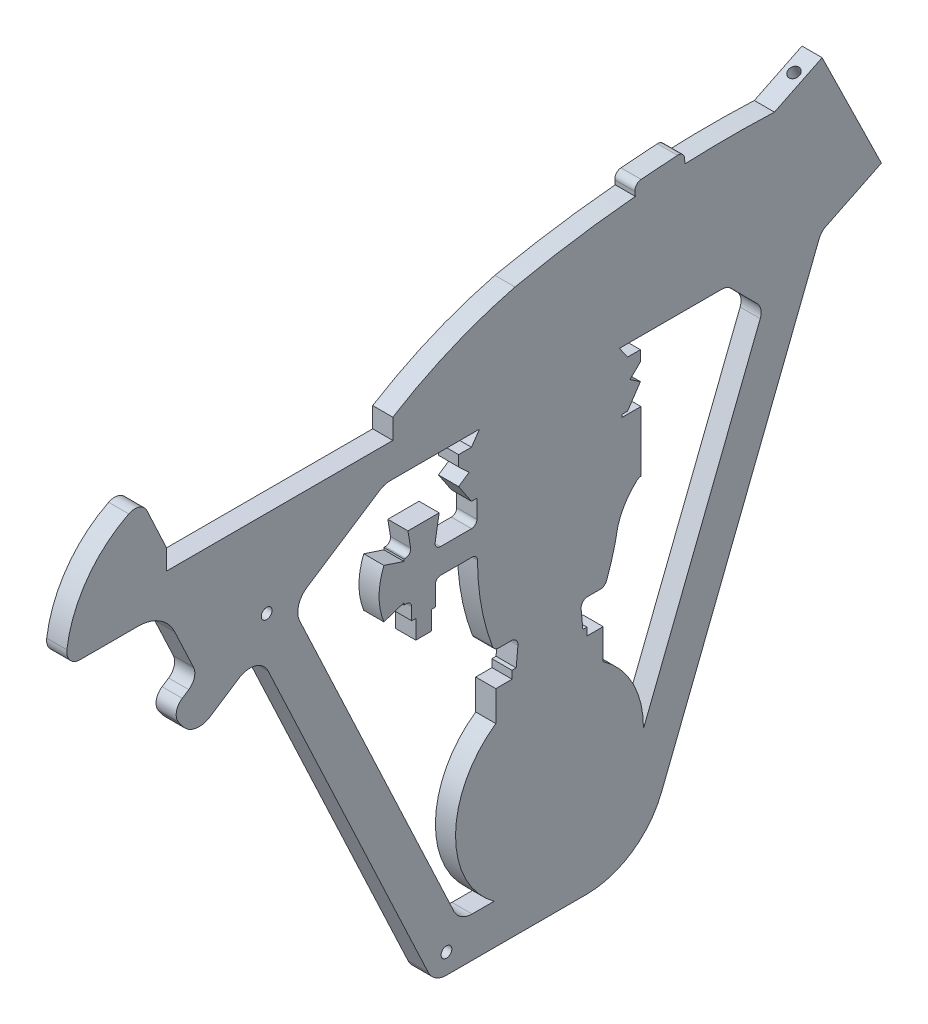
from build123d import *

# Parameters (mm, degrees)
SALIENTE_EXTRUIR1_DEPTH = 15
CORTAR_EXTRUIR1_DEPTH   = 14810.204250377
REDONDEO1_R             = 15
REDONDEO2_R             = 15
REDONDEO3_R             = 15
CROQUIS3_R              = 4
CORTAR_EXTRUIR2_DEPTH   = 14810.204250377
CROQUIS4_R              = 4
CORTAR_EXTRUIR3_DEPTH   = 14748.715475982
REDONDEO4_R             = 15
REDONDEO5_R             = 10
REDONDEO6_R             = 10
CROQUIS5_W              = 22.859676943
CROQUIS5_H              = 15
CORTAR_EXTRUIR4_DEPTH   = 14810.204250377
CORTAR_EXTRUIR5_DEPTH   = 14810.204250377
CROQUIS7_W              = 42.456295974
CROQUIS7_H              = 50.235503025
CORTAR_EXTRUIR6_DEPTH   = 14780.308510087
CROQUIS8_W              = 14
CROQUIS8_H              = 5
SALIENTE_EXTRUIR2_DEPTH = 15
CROQUIS9_R              = 0.25
CORTAR_EXTRUIR7_DEPTH   = 0.5
CROQUIS10_R             = 4
CORTAR_EXTRUIR8_DEPTH   = 14780.308510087


with BuildPart() as part:
    # Croquis1 → Saliente-Extruir1 (new body)
    with BuildSketch(Plane(origin=(0, 0, 0), x_dir=(0, 0, -1), z_dir=(1, 0, 0))):
        with BuildLine():
            Line((13423.45016071, 5176.45062716), (13446.309837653, 5191.45062716))
            ThreePointArc((13446.309837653, 5191.45062716), (13490.347191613, 5214.166576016), (13537.315735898, 5229.954505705))
            ThreePointArc((13537.315735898, 5229.954505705), (13581.936068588, 5238.062764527), (13626.954694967, 5243.543752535))
            Line((13626.954694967, 5243.543752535), (13626.643741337, 5246.919603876))
            ThreePointArc((13626.643741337, 5246.919603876), (13627.808133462, 5250.610764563), (13631.258265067, 5252.364921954))
            Line((13631.258265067, 5252.364921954), (13658.36232199, 5254.345527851))
            ThreePointArc((13658.36232199, 5254.345527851), (13662.0495379, 5253.09498381), (13663.721874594, 5249.578919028))
            Line((13663.721874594, 5249.578919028), (13663.877090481, 5246.056222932))
            ThreePointArc((13663.877090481, 5246.056222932), (13697.22878249, 5246.80612206), (13730.581809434, 5246.118152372))
            Line((13730.581809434, 5246.118152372), (13793.034702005, 5276.710112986))
            Line((13793.034702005, 5276.710112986), (13837.219226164, 5186.508266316))
            Line((13837.219226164, 5186.508266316), (13768.842688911, 5153.156150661))
            ThreePointArc((13768.842688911, 5153.156150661), (13765.882327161, 5150.955132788), (13763.921401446, 5147.830554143))
            Line((13763.921401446, 5147.830554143), (13646.500869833, 4849.477387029))
            ThreePointArc((13646.500869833, 4849.477387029), (13624.444960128, 4821.860333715), (13590.669187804, 4811.45062716))
            Line((13590.669187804, 4811.45062716), (13509.901226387, 4811.45062716))
            Line((13509.901226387, 4811.45062716), (13476.760270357, 4811.45062716))
            Line((13476.760270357, 4811.45062716), (13423.128893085, 4925.699967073))
            ThreePointArc((13423.128893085, 4925.699967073), (13419.438860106, 4929.891403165), (13414.0766497, 4931.45062716))
            Line((13414.0766497, 4931.45062716), (13332.695585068, 4931.45062716))
            ThreePointArc((13332.695585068, 4931.45062716), (13320.091026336, 5011.702550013), (13280.373286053, 5082.566836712))
            Line((13280.373286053, 5082.566836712), (13301.561361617, 5096.469969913))
            Line((13301.561361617, 5096.469969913), (13283.850616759, 5134.198646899))
            ThreePointArc((13283.850616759, 5134.198646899), (13272.780517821, 5146.772955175), (13256.693886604, 5151.45062716))
            Line((13256.693886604, 5151.45062716), (13202.749939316, 5151.45062716))
            ThreePointArc((13202.749939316, 5151.45062716), (13218.247044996, 5200.382699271), (13259.087531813, 5231.472289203))
            Line((13259.087531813, 5231.472289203), (13277.749939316, 5191.45062716))
            Line((13277.749939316, 5191.45062716), (13277.749939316, 5176.45062716))
            Line((13277.749939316, 5176.45062716), (13280.367986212, 5176.45062716))
            Line((13280.367986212, 5176.45062716), (13423.45016071, 5176.45062716))
        make_face()
        with BuildLine():
            Line((13371.429112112, 5106.433684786), (13440.033962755, 5151.45062716))
            Line((13440.033962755, 5151.45062716), (13510.904033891, 5151.45062716))
            Line((13510.904033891, 5151.45062716), (13504.887910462, 5142.79624059))
            Line((13504.887910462, 5142.79624059), (13495.318928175, 5142.79624059))
            Line((13495.318928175, 5142.79624059), (13495.318928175, 5134.848955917))
            Line((13495.318928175, 5134.848955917), (13503.135848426, 5127.440472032))
            Line((13503.135848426, 5127.440472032), (13495.318928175, 5122.187191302))
            Line((13495.318928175, 5122.187191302), (13504.887910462, 5107.886791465))
            Line((13504.887910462, 5107.886791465), (13508.934092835, 5107.886791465))
            Line((13508.934092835, 5107.886791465), (13508.934092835, 5094.225168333))
            ThreePointArc((13508.934092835, 5094.225168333), (13507.76251996, 5091.396741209), (13504.934092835, 5090.225168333))
            Line((13504.934092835, 5090.225168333), (13481.816459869, 5090.225168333))
            ThreePointArc((13481.816459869, 5090.225168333), (13478.763096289, 5091.64118481), (13477.871539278, 5094.886682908))
            Line((13477.871539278, 5094.886682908), (13480.823317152, 5112.489514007))
            Line((13480.823317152, 5112.489514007), (13457.567329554, 5112.489514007))
            Line((13457.567329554, 5112.489514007), (13459.58699107, 5100.445328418))
            ThreePointArc((13459.58699107, 5100.445328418), (13458.695434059, 5097.19983032), (13455.642070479, 5095.783813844))
            Line((13455.642070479, 5095.783813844), (13454.641416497, 5095.783813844))
            Line((13454.641416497, 5095.783813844), (13454.629889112, 5094.222705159))
            Line((13454.629889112, 5094.222705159), (13439.66406044, 5099.162802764))
            ThreePointArc((13439.66406044, 5099.162802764), (13436.101124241, 5080.930845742), (13439.66406044, 5062.69888872))
            Line((13439.66406044, 5062.69888872), (13454.629889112, 5067.638986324))
            Line((13454.629889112, 5067.638986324), (13454.641416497, 5066.077877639))
            Line((13454.641416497, 5066.077877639), (13456.408056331, 5066.077877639))
            ThreePointArc((13456.408056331, 5066.077877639), (13459.236483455, 5064.906304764), (13460.408056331, 5062.077877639))
            Line((13460.408056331, 5062.077877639), (13460.408056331, 5053.041515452))
            Line((13460.408056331, 5053.041515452), (13463.428683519, 5053.041515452))
            Line((13463.428683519, 5053.041515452), (13463.428683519, 5039.044575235))
            Line((13463.428683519, 5039.044575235), (13469.195323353, 5039.044575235))
            Line((13469.195323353, 5039.044575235), (13474.961963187, 5039.044575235))
            Line((13474.961963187, 5039.044575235), (13474.961963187, 5053.041515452))
            Line((13474.961963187, 5053.041515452), (13477.982590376, 5053.041515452))
            Line((13477.982590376, 5053.041515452), (13477.982590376, 5067.63652315))
            ThreePointArc((13477.982590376, 5067.63652315), (13479.154163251, 5070.464950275), (13481.982590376, 5071.63652315))
            Line((13481.982590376, 5071.63652315), (13505.372222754, 5071.63652315))
            ThreePointArc((13505.372222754, 5071.63652315), (13508.197915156, 5070.467682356), (13509.372215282, 5067.644254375))
            ThreePointArc((13509.372215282, 5067.644254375), (13512.21709306, 5036.513470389), (13520.541065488, 5006.381584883))
            ThreePointArc((13520.541065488, 5006.381584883), (13522.374724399, 5004.027434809), (13525.222786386, 5003.137002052))
            Line((13525.222786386, 5003.137002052), (13534.519912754, 5003.137002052))
            ThreePointArc((13534.519912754, 5003.137002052), (13538.216893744, 5001.503354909), (13539.498049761, 4997.669934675))
            Line((13539.498049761, 4997.669934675), (13538.195414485, 4983.786077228))
            Line((13538.195414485, 4983.786077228), (13535.153573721, 4983.722667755))
            Line((13535.153573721, 4983.722667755), (13535.153573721, 4977.989175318))
            Line((13535.153573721, 4977.989175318), (13523.029439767, 4977.989175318))
            Line((13523.029439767, 4977.989175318), (13523.029439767, 4955.434801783))
            ThreePointArc((13523.029439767, 4955.434801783), (13493.033799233, 4898.770396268), (13521.757263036, 4841.45062716))
            Line((13521.757263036, 4841.45062716), (13495.818507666, 4841.45062716))
            Line((13495.818507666, 4841.45062716), (13371.429112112, 5106.433684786))
        make_face(mode=Mode.SUBTRACT)
        with BuildLine():
            Line((13698.3806544, 5148.490160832), (13717.811150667, 5128.885970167))
            ThreePointArc((13717.811150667, 5128.885970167), (13720.503346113, 5123.86254329), (13720.013969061, 5118.184229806))
            Line((13720.013969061, 5118.184229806), (13633.024445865, 4897.153040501))
            ThreePointArc((13633.024445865, 4897.153040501), (13625.270232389, 4930.021717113), (13603.029439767, 4955.434801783))
            Line((13603.029439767, 4955.434801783), (13603.029439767, 4977.989175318))
            Line((13603.029439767, 4977.989175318), (13590.905305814, 4977.989175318))
            Line((13590.905305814, 4977.989175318), (13590.905305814, 4983.722667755))
            Line((13590.905305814, 4983.722667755), (13587.86346505, 4983.786077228))
            Line((13587.86346505, 4983.786077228), (13586.560829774, 4997.669934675))
            ThreePointArc((13586.560829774, 4997.669934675), (13587.841985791, 5001.503354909), (13591.538966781, 5003.137002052))
            Line((13591.538966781, 5003.137002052), (13600.836093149, 5003.137002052))
            ThreePointArc((13600.836093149, 5003.137002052), (13603.684155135, 5004.027434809), (13605.517814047, 5006.381584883))
            ThreePointArc((13605.517814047, 5006.381584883), (13610.499047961, 5021.796729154), (13614.037325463, 5037.605586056))
            ThreePointArc((13614.037325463, 5037.605586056), (13619.532453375, 5049.579941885), (13628.03481773, 5059.64430618))
            ThreePointArc((13628.03481773, 5059.64430618), (13629.589564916, 5060.59814165), (13631.382983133, 5060.930845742))
            Line((13631.382983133, 5060.930845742), (13645.777875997, 5060.930845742))
            ThreePointArc((13645.777875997, 5060.930845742), (13648.662835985, 5061.847096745), (13650.49045698, 5064.260043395))
            ThreePointArc((13650.49045698, 5064.260043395), (13653.358244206, 5080.930845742), (13650.49045698, 5097.601648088))
            ThreePointArc((13650.49045698, 5097.601648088), (13648.662835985, 5100.014594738), (13645.777875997, 5100.930845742))
            Line((13645.777875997, 5100.930845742), (13617.1247867, 5100.930845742))
            Line((13617.1247867, 5100.930845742), (13617.1247867, 5107.886791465))
            Line((13617.1247867, 5107.886791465), (13621.170969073, 5107.886791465))
            Line((13621.170969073, 5107.886791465), (13630.73995136, 5122.187191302))
            Line((13630.73995136, 5122.187191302), (13622.923031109, 5127.440472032))
            Line((13622.923031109, 5127.440472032), (13630.73995136, 5134.848955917))
            Line((13630.73995136, 5134.848955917), (13630.73995136, 5142.79624059))
            Line((13630.73995136, 5142.79624059), (13621.170969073, 5142.79624059))
            Line((13621.170969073, 5142.79624059), (13615.154845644, 5151.45062716))
            Line((13615.154845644, 5151.45062716), (13691.278192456, 5151.45062716))
            ThreePointArc((13691.278192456, 5151.45062716), (13695.125572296, 5150.680885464), (13698.3806544, 5148.490160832))
        make_face(mode=Mode.SUBTRACT)
    extrude(amount=SALIENTE_EXTRUIR1_DEPTH)

    # Croquis2 → Cortar-Extruir1 (cut, through all)
    with BuildSketch(Plane(origin=(15, 0, 0), x_dir=(0, 0, -1), z_dir=(1, 0, 0))):
        with BuildLine():
            Line((13423.128893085, 4925.699967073), (13346.092480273, 5089.808363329))
            Line((13346.092480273, 5089.808363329), (13297.894657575, 5058.182048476))
            ThreePointArc((13297.894657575, 5058.182048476), (13324.539631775, 4997.354915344), (13332.695585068, 4931.45062716))
            Line((13332.695585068, 4931.45062716), (13414.0766497, 4931.45062716))
            ThreePointArc((13414.0766497, 4931.45062716), (13419.438860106, 4929.891403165), (13423.128893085, 4925.699967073))
        make_face()
    extrude(amount=-CORTAR_EXTRUIR1_DEPTH, mode=Mode.SUBTRACT)

    # Redondeo1
    redondeo1_edges = [part.edges().sort_by_distance(p)[0] for p in [
        (7.5, 5151.45062716, -13440.033962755),
        (7.5, 5106.433684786, -13371.429112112),
    ]]
    fillet(redondeo1_edges, radius=REDONDEO1_R)

    # Redondeo2
    redondeo2_edges = [part.edges().sort_by_distance(p)[0] for p in [
        (7.5, 4841.45062716, -13495.818507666),
        (7.5, 4811.45062716, -13476.760270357),
    ]]
    fillet(redondeo2_edges, radius=REDONDEO2_R)

    # Redondeo3
    redondeo3_edges = [part.edges().sort_by_distance(p)[0] for p in [
        (7.5, 5089.808363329, -13346.092480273),
    ]]
    fillet(redondeo3_edges, radius=REDONDEO3_R)

    # Croquis3 → Cortar-Extruir2 (cut, through all)
    with BuildSketch(Plane(origin=(15, 0, 0), x_dir=(0, 0, -1), z_dir=(1, 0, 0))):
        with Locations((13486.289389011, 4826.45062716)):
            Circle(CROQUIS3_R)
    extrude(amount=-CORTAR_EXTRUIR2_DEPTH, mode=Mode.SUBTRACT)

    # Croquis4 → Cortar-Extruir3 (cut, through all)
    with BuildSketch(Plane(origin=(0, -1193.342722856, -584.547681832), x_dir=(1, 0, 0), z_dir=(0, 0.8980468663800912, 0.4398997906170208))):
        with Locations(Location((7.5, 14663.015265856, 0), (0, 0, 270))):
            Circle(CROQUIS4_R)
    extrude(amount=-CORTAR_EXTRUIR3_DEPTH, mode=Mode.SUBTRACT)

    # Redondeo4
    redondeo4_edges = [part.edges().sort_by_distance(p)[0] for p in [
        (7.5, 5058.182048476, -13297.894657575),
    ]]
    fillet(redondeo4_edges, radius=REDONDEO4_R)

    # Redondeo5
    redondeo5_edges = [part.edges().sort_by_distance(p)[0] for p in [
        (7.5, 5082.566836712, -13280.373286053),
        (7.5, 5096.469969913, -13301.561361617),
    ]]
    fillet(redondeo5_edges, radius=REDONDEO5_R)

    # Redondeo6
    redondeo6_edges = [part.edges().sort_by_distance(p)[0] for p in [
        (7.5, 5151.45062716, -13202.749939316),
        (7.5, 5231.472289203, -13259.087531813),
    ]]
    fillet(redondeo6_edges, radius=REDONDEO6_R)

    # Croquis5 → Cortar-Extruir4 (cut, through all)
    with BuildSketch(Plane.ZY):
        with Locations((-13434.879999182, 5183.95062716)):
            Rectangle(CROQUIS5_W, CROQUIS5_H)
    extrude(amount=-CORTAR_EXTRUIR4_DEPTH, mode=Mode.SUBTRACT)

    # Croquis6 → Cortar-Extruir5 (cut, through all)
    with BuildSketch(Plane.ZY):
        Polygon((-13793.034702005, 5276.710112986), (-13837.219226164, 5186.508266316), (-13810.277820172, 5173.311272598), (-13766.093296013, 5263.513119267), align=None)
    extrude(amount=-CORTAR_EXTRUIR5_DEPTH, mode=Mode.SUBTRACT)

    # Croquis7 → Cortar-Extruir6 (cut, through all)
    with BuildSketch(Plane.ZY):
        with Locations((-13652.352934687, 5078.588883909)):
            Rectangle(CROQUIS7_W, CROQUIS7_H)
    extrude(amount=-CORTAR_EXTRUIR6_DEPTH, mode=Mode.SUBTRACT)

    # Croquis8 → Saliente-Extruir2 (add)
    with BuildSketch(Plane.ZY):
        with Locations((-13624.1247867, 5103.430845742)):
            Rectangle(CROQUIS8_W, CROQUIS8_H)
    extrude(amount=-SALIENTE_EXTRUIR2_DEPTH)

    # Croquis9 → Cortar-Extruir7 (cut)
    with BuildSketch(Plane(origin=(0, 0, -13631.1247867), x_dir=(-1, 0, 0), z_dir=(0, 0, -1))):
        with Locations((-7.5, 5083.430845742)):
            Circle(CROQUIS9_R)
    extrude(amount=-CORTAR_EXTRUIR7_DEPTH, mode=Mode.SUBTRACT)

    # Croquis10 → Cortar-Extruir8 (cut, through all)
    with BuildSketch(Plane.ZY):
        with Locations((-13352.322147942, 5111.837086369)):
            Circle(CROQUIS10_R)
    extrude(amount=-CORTAR_EXTRUIR8_DEPTH, mode=Mode.SUBTRACT)


solid = part.part
